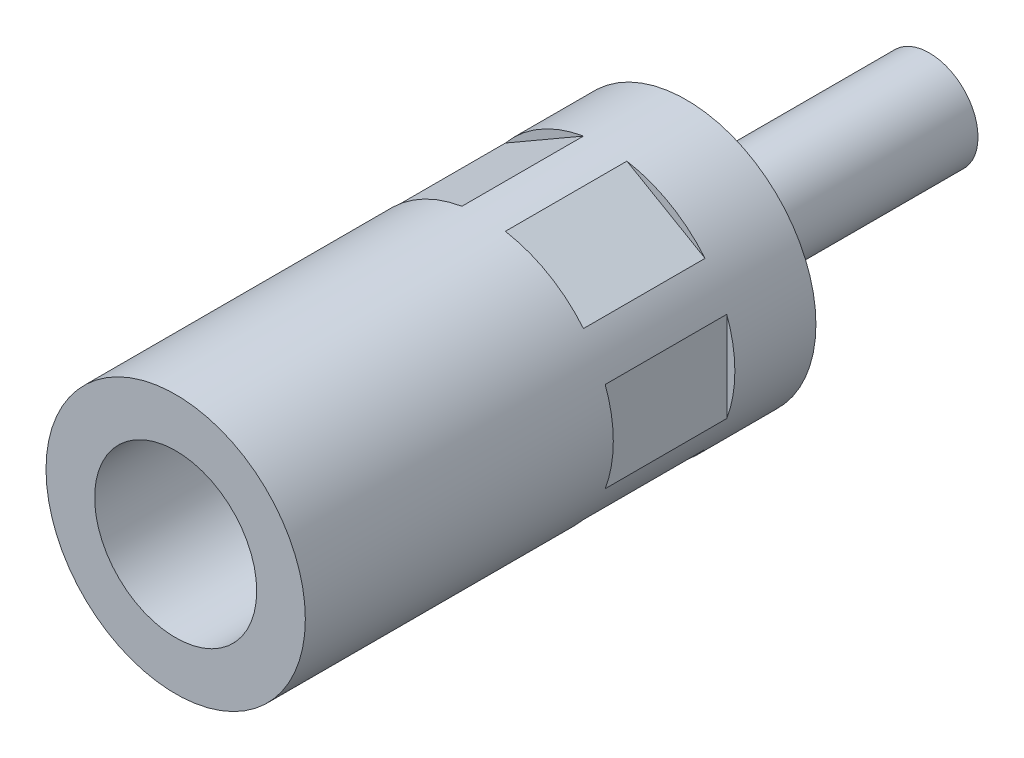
ISO-10303-21;
HEADER;
FILE_DESCRIPTION(('STEP AP214'),'2;1');
FILE_NAME('part.step','',(''),(''),'','','');
FILE_SCHEMA(('AUTOMOTIVE_DESIGN { 1 0 10303 214 1 1 1 1 }'));
ENDSEC;
DATA;
#1=APPLICATION_CONTEXT('core data for automotive mechanical design processes');
#2=APPLICATION_PROTOCOL_DEFINITION('international standard','automotive_design',2000,#1);
#3=PRODUCT_CONTEXT('',#1,'mechanical');
#4=PRODUCT('Part','Part','',(#3));
#5=PRODUCT_RELATED_PRODUCT_CATEGORY('part','',(#4));
#6=PRODUCT_DEFINITION_FORMATION('','',#4);
#7=PRODUCT_DEFINITION_CONTEXT('part definition',#1,'design');
#8=PRODUCT_DEFINITION('design','',#6,#7);
#9=PRODUCT_DEFINITION_SHAPE('','',#8);
#10=(LENGTH_UNIT() NAMED_UNIT(*) SI_UNIT(.MILLI.,.METRE.));
#11=(NAMED_UNIT(*) PLANE_ANGLE_UNIT() SI_UNIT($,.RADIAN.));
#12=(NAMED_UNIT(*) SI_UNIT($,.STERADIAN.) SOLID_ANGLE_UNIT());
#13=UNCERTAINTY_MEASURE_WITH_UNIT(LENGTH_MEASURE(1.E-05),#10,'distance_accuracy_value','');
#14=(GEOMETRIC_REPRESENTATION_CONTEXT(3) GLOBAL_UNCERTAINTY_ASSIGNED_CONTEXT((#13)) GLOBAL_UNIT_ASSIGNED_CONTEXT((#10,
#11,#12)) REPRESENTATION_CONTEXT('',''));
#15=CARTESIAN_POINT('',(0.,0.,0.));
#16=DIRECTION('',(0.,0.,1.));
#17=DIRECTION('',(1.,0.,0.));
#18=AXIS2_PLACEMENT_3D('',#15,#16,#17);
#19=CARTESIAN_POINT('',(0.,0.,80.));
#20=DIRECTION('',(0.,0.,1.));
#21=DIRECTION('',(1.,0.,0.));
#22=AXIS2_PLACEMENT_3D('',#19,#20,#21);
#23=CYLINDRICAL_SURFACE('',#22,16.);
#24=CARTESIAN_POINT('',(0.,0.,10.));
#25=DIRECTION('',(0.,0.,1.));
#26=DIRECTION('',(1.,0.,0.));
#27=AXIS2_PLACEMENT_3D('',#24,#25,#26);
#28=CIRCLE('',#27,16.);
#29=CARTESIAN_POINT('',(-12.3218253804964,-10.2064988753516,10.));
#30=VERTEX_POINT('',#29);
#31=CARTESIAN_POINT('',(-2.67817461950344,-15.7742632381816,10.));
#32=VERTEX_POINT('',#31);
#33=EDGE_CURVE('E153',#30,#32,#28,.T.);
#34=ORIENTED_EDGE('',*,*,#33,.F.);
#35=DIRECTION('',(0.,0.,1.));
#36=VECTOR('',#35,1.);
#37=CARTESIAN_POINT('',(-12.3218253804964,-10.2064988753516,80.));
#38=LINE('',#37,#36);
#39=CARTESIAN_POINT('',(-12.3218253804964,-10.2064988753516,25.));
#40=VERTEX_POINT('',#39);
#41=EDGE_CURVE('E9',#30,#40,#38,.T.);
#42=ORIENTED_EDGE('',*,*,#41,.T.);
#43=CARTESIAN_POINT('',(0.,0.,25.));
#44=DIRECTION('',(0.,0.,1.));
#45=DIRECTION('',(1.,0.,0.));
#46=AXIS2_PLACEMENT_3D('',#43,#44,#45);
#47=CIRCLE('',#46,16.);
#48=CARTESIAN_POINT('',(-2.67817461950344,-15.7742632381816,25.));
#49=VERTEX_POINT('',#48);
#50=EDGE_CURVE('E22',#40,#49,#47,.T.);
#51=ORIENTED_EDGE('',*,*,#50,.T.);
#52=DIRECTION('',(0.,0.,1.));
#53=VECTOR('',#52,1.);
#54=CARTESIAN_POINT('',(-2.67817461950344,-15.7742632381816,80.));
#55=LINE('',#54,#53);
#56=EDGE_CURVE('E150',#49,#32,#55,.F.);
#57=ORIENTED_EDGE('',*,*,#56,.T.);
#58=EDGE_LOOP('',(#34,#42,#51,#57));
#59=FACE_BOUND('',#58,.T.);
#60=DIRECTION('',(0.,0.,1.));
#61=VECTOR('',#60,1.);
#62=CARTESIAN_POINT('',(15.,5.56776436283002,80.));
#63=LINE('',#62,#61);
#64=CARTESIAN_POINT('',(15.,5.56776436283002,10.));
#65=VERTEX_POINT('',#64);
#66=CARTESIAN_POINT('',(15.,5.56776436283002,25.));
#67=VERTEX_POINT('',#66);
#68=EDGE_CURVE('E143',#65,#67,#63,.T.);
#69=ORIENTED_EDGE('',*,*,#68,.F.);
#70=CARTESIAN_POINT('',(15.,-5.56776436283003,10.));
#71=VERTEX_POINT('',#70);
#72=EDGE_CURVE('E142',#71,#65,#28,.T.);
#73=ORIENTED_EDGE('',*,*,#72,.F.);
#74=DIRECTION('',(0.,0.,1.));
#75=VECTOR('',#74,1.);
#76=CARTESIAN_POINT('',(15.,-5.56776436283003,80.));
#77=LINE('',#76,#75);
#78=CARTESIAN_POINT('',(15.,-5.56776436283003,25.));
#79=VERTEX_POINT('',#78);
#80=EDGE_CURVE('E139',#79,#71,#77,.F.);
#81=ORIENTED_EDGE('',*,*,#80,.F.);
#82=EDGE_CURVE('E146',#79,#67,#47,.T.);
#83=ORIENTED_EDGE('',*,*,#82,.T.);
#84=EDGE_LOOP('',(#69,#73,#81,#83));
#85=FACE_BOUND('',#84,.T.);
#86=CARTESIAN_POINT('',(12.3218253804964,10.2064988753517,10.));
#87=VERTEX_POINT('',#86);
#88=CARTESIAN_POINT('',(2.67817461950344,15.7742632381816,10.));
#89=VERTEX_POINT('',#88);
#90=EDGE_CURVE('E135',#87,#89,#28,.T.);
#91=ORIENTED_EDGE('',*,*,#90,.F.);
#92=DIRECTION('',(0.,0.,1.));
#93=VECTOR('',#92,1.);
#94=CARTESIAN_POINT('',(12.3218253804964,10.2064988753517,80.));
#95=LINE('',#94,#93);
#96=CARTESIAN_POINT('',(12.3218253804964,10.2064988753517,25.));
#97=VERTEX_POINT('',#96);
#98=EDGE_CURVE('E136',#87,#97,#95,.T.);
#99=ORIENTED_EDGE('',*,*,#98,.T.);
#100=CARTESIAN_POINT('',(2.67817461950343,15.7742632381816,25.));
#101=VERTEX_POINT('',#100);
#102=EDGE_CURVE('E140',#97,#101,#47,.T.);
#103=ORIENTED_EDGE('',*,*,#102,.T.);
#104=DIRECTION('',(0.,0.,1.));
#105=VECTOR('',#104,1.);
#106=CARTESIAN_POINT('',(2.67817461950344,15.7742632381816,80.));
#107=LINE('',#106,#105);
#108=EDGE_CURVE('E132',#101,#89,#107,.F.);
#109=ORIENTED_EDGE('',*,*,#108,.T.);
#110=EDGE_LOOP('',(#91,#99,#103,#109));
#111=FACE_BOUND('',#110,.T.);
#112=CARTESIAN_POINT('',(0.,0.,0.));
#113=DIRECTION('',(0.,0.,1.));
#114=DIRECTION('',(1.,0.,0.));
#115=AXIS2_PLACEMENT_3D('',#112,#113,#114);
#116=CIRCLE('',#115,16.);
#117=CARTESIAN_POINT('',(16.,0.,0.));
#118=VERTEX_POINT('',#117);
#119=EDGE_CURVE('E202',#118,#118,#116,.T.);
#120=ORIENTED_EDGE('',*,*,#119,.T.);
#121=EDGE_LOOP('',(#120));
#122=FACE_BOUND('',#121,.T.);
#123=CARTESIAN_POINT('',(0.,0.,63.));
#124=DIRECTION('',(0.,0.,1.));
#125=DIRECTION('',(1.,0.,0.));
#126=AXIS2_PLACEMENT_3D('',#123,#124,#125);
#127=CIRCLE('',#126,16.);
#128=CARTESIAN_POINT('',(16.,0.,63.));
#129=VERTEX_POINT('',#128);
#130=EDGE_CURVE('E205',#129,#129,#127,.T.);
#131=ORIENTED_EDGE('',*,*,#130,.F.);
#132=EDGE_LOOP('',(#131));
#133=FACE_BOUND('',#132,.T.);
#134=CARTESIAN_POINT('',(-15.,5.56776436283,10.));
#135=VERTEX_POINT('',#134);
#136=CARTESIAN_POINT('',(-15.,-5.56776436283,10.));
#137=VERTEX_POINT('',#136);
#138=EDGE_CURVE('E111',#135,#137,#28,.T.);
#139=ORIENTED_EDGE('',*,*,#138,.F.);
#140=DIRECTION('',(0.,0.,1.));
#141=VECTOR('',#140,1.);
#142=CARTESIAN_POINT('',(-15.,5.56776436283,80.));
#143=LINE('',#142,#141);
#144=CARTESIAN_POINT('',(-15.,5.56776436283,25.));
#145=VERTEX_POINT('',#144);
#146=EDGE_CURVE('E110',#135,#145,#143,.T.);
#147=ORIENTED_EDGE('',*,*,#146,.T.);
#148=CARTESIAN_POINT('',(-15.,-5.56776436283,25.));
#149=VERTEX_POINT('',#148);
#150=EDGE_CURVE('E103',#145,#149,#47,.T.);
#151=ORIENTED_EDGE('',*,*,#150,.T.);
#152=DIRECTION('',(0.,0.,1.));
#153=VECTOR('',#152,1.);
#154=CARTESIAN_POINT('',(-15.,-5.56776436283,80.));
#155=LINE('',#154,#153);
#156=EDGE_CURVE('E117',#149,#137,#155,.F.);
#157=ORIENTED_EDGE('',*,*,#156,.T.);
#158=EDGE_LOOP('',(#139,#147,#151,#157));
#159=FACE_BOUND('',#158,.T.);
#160=DIRECTION('',(0.,0.,1.));
#161=VECTOR('',#160,1.);
#162=CARTESIAN_POINT('',(-12.3218253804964,10.2064988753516,80.));
#163=LINE('',#162,#161);
#164=CARTESIAN_POINT('',(-12.3218253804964,10.2064988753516,10.));
#165=VERTEX_POINT('',#164);
#166=CARTESIAN_POINT('',(-12.3218253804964,10.2064988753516,25.));
#167=VERTEX_POINT('',#166);
#168=EDGE_CURVE('E130',#165,#167,#163,.T.);
#169=ORIENTED_EDGE('',*,*,#168,.F.);
#170=CARTESIAN_POINT('',(-2.67817461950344,15.7742632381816,10.));
#171=VERTEX_POINT('',#170);
#172=EDGE_CURVE('E126',#171,#165,#28,.T.);
#173=ORIENTED_EDGE('',*,*,#172,.F.);
#174=DIRECTION('',(0.,0.,1.));
#175=VECTOR('',#174,1.);
#176=CARTESIAN_POINT('',(-2.67817461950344,15.7742632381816,80.));
#177=LINE('',#176,#175);
#178=CARTESIAN_POINT('',(-2.67817461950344,15.7742632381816,25.));
#179=VERTEX_POINT('',#178);
#180=EDGE_CURVE('E124',#179,#171,#177,.F.);
#181=ORIENTED_EDGE('',*,*,#180,.F.);
#182=EDGE_CURVE('E113',#179,#167,#47,.T.);
#183=ORIENTED_EDGE('',*,*,#182,.T.);
#184=EDGE_LOOP('',(#169,#173,#181,#183));
#185=FACE_BOUND('',#184,.T.);
#186=DIRECTION('',(0.,0.,1.));
#187=VECTOR('',#186,1.);
#188=CARTESIAN_POINT('',(12.3218253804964,-10.2064988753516,80.));
#189=LINE('',#188,#187);
#190=CARTESIAN_POINT('',(12.3218253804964,-10.2064988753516,10.));
#191=VERTEX_POINT('',#190);
#192=CARTESIAN_POINT('',(12.3218253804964,-10.2064988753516,25.));
#193=VERTEX_POINT('',#192);
#194=EDGE_CURVE('E149',#191,#193,#189,.T.);
#195=ORIENTED_EDGE('',*,*,#194,.F.);
#196=CARTESIAN_POINT('',(2.67817461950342,-15.7742632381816,10.));
#197=VERTEX_POINT('',#196);
#198=EDGE_CURVE('E148',#197,#191,#28,.T.);
#199=ORIENTED_EDGE('',*,*,#198,.F.);
#200=DIRECTION('',(0.,0.,1.));
#201=VECTOR('',#200,1.);
#202=CARTESIAN_POINT('',(2.67817461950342,-15.7742632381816,80.));
#203=LINE('',#202,#201);
#204=CARTESIAN_POINT('',(2.67817461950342,-15.7742632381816,25.));
#205=VERTEX_POINT('',#204);
#206=EDGE_CURVE('E145',#205,#197,#203,.F.);
#207=ORIENTED_EDGE('',*,*,#206,.F.);
#208=EDGE_CURVE('E151',#205,#193,#47,.T.);
#209=ORIENTED_EDGE('',*,*,#208,.T.);
#210=EDGE_LOOP('',(#195,#199,#207,#209));
#211=FACE_BOUND('',#210,.T.);
#212=ADVANCED_FACE('F14',(#59,#85,#111,#122,#133,#159,#185,#211),#23,.T.);
#213=CARTESIAN_POINT('',(0.,0.,-30.));
#214=DIRECTION('',(0.,0.,1.));
#215=DIRECTION('',(1.,0.,0.));
#216=AXIS2_PLACEMENT_3D('',#213,#214,#215);
#217=PLANE('',#216);
#218=CARTESIAN_POINT('',(0.,0.,-30.));
#219=DIRECTION('',(0.,0.,1.));
#220=DIRECTION('',(1.,0.,0.));
#221=AXIS2_PLACEMENT_3D('',#218,#219,#220);
#222=CIRCLE('',#221,6.);
#223=CARTESIAN_POINT('',(6.,0.,-30.));
#224=VERTEX_POINT('',#223);
#225=EDGE_CURVE('E118',#224,#224,#222,.T.);
#226=ORIENTED_EDGE('',*,*,#225,.F.);
#227=EDGE_LOOP('',(#226));
#228=FACE_BOUND('',#227,.T.);
#229=ADVANCED_FACE('F16',(#228),#217,.F.);
#230=CARTESIAN_POINT('',(5.,0.,9.));
#231=DIRECTION('',(0.,0.,-1.));
#232=DIRECTION('',(-1.,0.,0.));
#233=AXIS2_PLACEMENT_3D('',#230,#231,#232);
#234=PLANE('',#233);
#235=CARTESIAN_POINT('',(0.,0.,9.));
#236=DIRECTION('',(0.,0.,1.));
#237=DIRECTION('',(1.,0.,0.));
#238=AXIS2_PLACEMENT_3D('',#235,#236,#237);
#239=CIRCLE('',#238,5.);
#240=CARTESIAN_POINT('',(5.,0.,9.));
#241=VERTEX_POINT('',#240);
#242=EDGE_CURVE('E160',#241,#241,#239,.T.);
#243=ORIENTED_EDGE('',*,*,#242,.T.);
#244=EDGE_LOOP('',(#243));
#245=FACE_BOUND('',#244,.T.);
#246=ADVANCED_FACE('F220',(#245),#234,.F.);
#247=CARTESIAN_POINT('',(0.,0.,80.));
#248=DIRECTION('',(0.,0.,1.));
#249=DIRECTION('',(1.,0.,0.));
#250=AXIS2_PLACEMENT_3D('',#247,#248,#249);
#251=CYLINDRICAL_SURFACE('',#250,5.);
#252=ORIENTED_EDGE('',*,*,#242,.F.);
#253=EDGE_LOOP('',(#252));
#254=FACE_BOUND('',#253,.T.);
#255=CARTESIAN_POINT('',(0.,0.,33.));
#256=DIRECTION('',(0.,0.,1.));
#257=DIRECTION('',(1.,0.,0.));
#258=AXIS2_PLACEMENT_3D('',#255,#256,#257);
#259=CIRCLE('',#258,5.);
#260=CARTESIAN_POINT('',(5.,0.,33.));
#261=VERTEX_POINT('',#260);
#262=EDGE_CURVE('E214',#261,#261,#259,.T.);
#263=ORIENTED_EDGE('',*,*,#262,.T.);
#264=EDGE_LOOP('',(#263));
#265=FACE_BOUND('',#264,.T.);
#266=ADVANCED_FACE('F222',(#254,#265),#251,.F.);
#267=CARTESIAN_POINT('',(5.,0.,33.));
#268=DIRECTION('',(0.,0.,1.));
#269=DIRECTION('',(1.,0.,0.));
#270=AXIS2_PLACEMENT_3D('',#267,#268,#269);
#271=PLANE('',#270);
#272=CARTESIAN_POINT('',(0.,0.,33.));
#273=DIRECTION('',(0.,0.,1.));
#274=DIRECTION('',(1.,0.,0.));
#275=AXIS2_PLACEMENT_3D('',#272,#273,#274);
#276=CIRCLE('',#275,10.);
#277=CARTESIAN_POINT('',(10.,0.,33.));
#278=VERTEX_POINT('',#277);
#279=EDGE_CURVE('E211',#278,#278,#276,.T.);
#280=ORIENTED_EDGE('',*,*,#279,.T.);
#281=EDGE_LOOP('',(#280));
#282=FACE_BOUND('',#281,.T.);
#283=ORIENTED_EDGE('',*,*,#262,.F.);
#284=EDGE_LOOP('',(#283));
#285=FACE_BOUND('',#284,.T.);
#286=ADVANCED_FACE('F225',(#282,#285),#271,.T.);
#287=CARTESIAN_POINT('',(0.,0.,80.));
#288=DIRECTION('',(0.,0.,1.));
#289=DIRECTION('',(1.,0.,0.));
#290=AXIS2_PLACEMENT_3D('',#287,#288,#289);
#291=CYLINDRICAL_SURFACE('',#290,10.);
#292=ORIENTED_EDGE('',*,*,#279,.F.);
#293=EDGE_LOOP('',(#292));
#294=FACE_BOUND('',#293,.T.);
#295=CARTESIAN_POINT('',(0.,0.,63.));
#296=DIRECTION('',(0.,0.,1.));
#297=DIRECTION('',(1.,0.,0.));
#298=AXIS2_PLACEMENT_3D('',#295,#296,#297);
#299=CIRCLE('',#298,10.);
#300=CARTESIAN_POINT('',(10.,0.,63.));
#301=VERTEX_POINT('',#300);
#302=EDGE_CURVE('E208',#301,#301,#299,.T.);
#303=ORIENTED_EDGE('',*,*,#302,.T.);
#304=EDGE_LOOP('',(#303));
#305=FACE_BOUND('',#304,.T.);
#306=ADVANCED_FACE('F230',(#294,#305),#291,.F.);
#307=CARTESIAN_POINT('',(16.,0.,63.));
#308=DIRECTION('',(0.,0.,-1.));
#309=DIRECTION('',(-1.,0.,0.));
#310=AXIS2_PLACEMENT_3D('',#307,#308,#309);
#311=PLANE('',#310);
#312=ORIENTED_EDGE('',*,*,#302,.F.);
#313=EDGE_LOOP('',(#312));
#314=FACE_BOUND('',#313,.T.);
#315=ORIENTED_EDGE('',*,*,#130,.T.);
#316=EDGE_LOOP('',(#315));
#317=FACE_BOUND('',#316,.T.);
#318=ADVANCED_FACE('F238',(#314,#317),#311,.F.);
#319=CARTESIAN_POINT('',(16.,0.,0.));
#320=DIRECTION('',(0.,0.,-1.));
#321=DIRECTION('',(-1.,0.,0.));
#322=AXIS2_PLACEMENT_3D('',#319,#320,#321);
#323=PLANE('',#322);
#324=CARTESIAN_POINT('',(0.,0.,0.));
#325=DIRECTION('',(0.,0.,1.));
#326=DIRECTION('',(1.,0.,0.));
#327=AXIS2_PLACEMENT_3D('',#324,#325,#326);
#328=CIRCLE('',#327,6.);
#329=CARTESIAN_POINT('',(6.,0.,0.));
#330=VERTEX_POINT('',#329);
#331=EDGE_CURVE('E199',#330,#330,#328,.T.);
#332=ORIENTED_EDGE('',*,*,#331,.T.);
#333=EDGE_LOOP('',(#332));
#334=FACE_BOUND('',#333,.T.);
#335=ORIENTED_EDGE('',*,*,#119,.F.);
#336=EDGE_LOOP('',(#335));
#337=FACE_BOUND('',#336,.T.);
#338=ADVANCED_FACE('F250',(#334,#337),#323,.T.);
#339=CARTESIAN_POINT('',(0.,0.,80.));
#340=DIRECTION('',(0.,0.,1.));
#341=DIRECTION('',(1.,0.,0.));
#342=AXIS2_PLACEMENT_3D('',#339,#340,#341);
#343=CYLINDRICAL_SURFACE('',#342,6.);
#344=ORIENTED_EDGE('',*,*,#331,.F.);
#345=EDGE_LOOP('',(#344));
#346=FACE_BOUND('',#345,.T.);
#347=ORIENTED_EDGE('',*,*,#225,.T.);
#348=EDGE_LOOP('',(#347));
#349=FACE_BOUND('',#348,.T.);
#350=ADVANCED_FACE('F258',(#346,#349),#343,.T.);
#351=CARTESIAN_POINT('',(-15.,8.66025403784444,25.));
#352=DIRECTION('',(1.,0.,0.));
#353=DIRECTION('',(0.,1.,0.));
#354=AXIS2_PLACEMENT_3D('',#351,#352,#353);
#355=PLANE('',#354);
#356=DIRECTION('',(0.,-1.,0.));
#357=VECTOR('',#356,1.);
#358=CARTESIAN_POINT('',(-15.,8.66025403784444,10.));
#359=LINE('',#358,#357);
#360=EDGE_CURVE('E193',#135,#137,#359,.T.);
#361=ORIENTED_EDGE('',*,*,#360,.T.);
#362=ORIENTED_EDGE('',*,*,#156,.F.);
#363=DIRECTION('',(0.,-1.,0.));
#364=VECTOR('',#363,1.);
#365=CARTESIAN_POINT('',(-15.,8.66025403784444,25.));
#366=LINE('',#365,#364);
#367=EDGE_CURVE('E106',#145,#149,#366,.T.);
#368=ORIENTED_EDGE('',*,*,#367,.F.);
#369=ORIENTED_EDGE('',*,*,#146,.F.);
#370=EDGE_LOOP('',(#361,#362,#368,#369));
#371=FACE_BOUND('',#370,.T.);
#372=ADVANCED_FACE('F115',(#371),#355,.F.);
#373=CARTESIAN_POINT('',(0.,0.,10.));
#374=DIRECTION('',(0.,0.,1.));
#375=DIRECTION('',(1.,0.,0.));
#376=AXIS2_PLACEMENT_3D('',#373,#374,#375);
#377=PLANE('',#376);
#378=ORIENTED_EDGE('',*,*,#138,.T.);
#379=ORIENTED_EDGE('',*,*,#360,.F.);
#380=EDGE_LOOP('',(#378,#379));
#381=FACE_BOUND('',#380,.T.);
#382=ADVANCED_FACE('F280',(#381),#377,.T.);
#383=CARTESIAN_POINT('',(0.,0.,25.));
#384=DIRECTION('',(0.,0.,1.));
#385=DIRECTION('',(1.,0.,0.));
#386=AXIS2_PLACEMENT_3D('',#383,#384,#385);
#387=PLANE('',#386);
#388=ORIENTED_EDGE('',*,*,#367,.T.);
#389=ORIENTED_EDGE('',*,*,#150,.F.);
#390=EDGE_LOOP('',(#388,#389));
#391=FACE_BOUND('',#390,.T.);
#392=ADVANCED_FACE('F105',(#391),#387,.F.);
#393=CARTESIAN_POINT('',(-15.,8.66025403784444,25.));
#394=DIRECTION('',(-0.5,0.866025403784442,0.));
#395=DIRECTION('',(-0.866025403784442,-0.5,0.));
#396=AXIS2_PLACEMENT_3D('',#393,#394,#395);
#397=PLANE('',#396);
#398=ORIENTED_EDGE('',*,*,#168,.T.);
#399=DIRECTION('',(0.866025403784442,0.5,0.));
#400=VECTOR('',#399,1.);
#401=CARTESIAN_POINT('',(-15.,8.66025403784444,25.));
#402=LINE('',#401,#400);
#403=EDGE_CURVE('E119',#167,#179,#402,.T.);
#404=ORIENTED_EDGE('',*,*,#403,.T.);
#405=ORIENTED_EDGE('',*,*,#180,.T.);
#406=DIRECTION('',(0.866025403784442,0.5,0.));
#407=VECTOR('',#406,1.);
#408=CARTESIAN_POINT('',(-15.,8.66025403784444,10.));
#409=LINE('',#408,#407);
#410=EDGE_CURVE('E344',#165,#171,#409,.T.);
#411=ORIENTED_EDGE('',*,*,#410,.F.);
#412=EDGE_LOOP('',(#398,#404,#405,#411));
#413=FACE_BOUND('',#412,.T.);
#414=ADVANCED_FACE('F306',(#413),#397,.T.);
#415=ORIENTED_EDGE('',*,*,#172,.T.);
#416=ORIENTED_EDGE('',*,*,#410,.T.);
#417=EDGE_LOOP('',(#415,#416));
#418=FACE_BOUND('',#417,.T.);
#419=ADVANCED_FACE('F294',(#418),#377,.T.);
#420=ORIENTED_EDGE('',*,*,#403,.F.);
#421=ORIENTED_EDGE('',*,*,#182,.F.);
#422=EDGE_LOOP('',(#420,#421));
#423=FACE_BOUND('',#422,.T.);
#424=ADVANCED_FACE('F289',(#423),#387,.F.);
#425=CARTESIAN_POINT('',(15.,8.66025403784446,25.));
#426=DIRECTION('',(-0.499999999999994,-0.866025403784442,0.));
#427=DIRECTION('',(0.866025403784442,-0.499999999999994,0.));
#428=AXIS2_PLACEMENT_3D('',#425,#426,#427);
#429=PLANE('',#428);
#430=DIRECTION('',(-0.866025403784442,0.499999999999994,0.));
#431=VECTOR('',#430,1.);
#432=CARTESIAN_POINT('',(15.,8.66025403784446,10.));
#433=LINE('',#432,#431);
#434=EDGE_CURVE('E345',#87,#89,#433,.T.);
#435=ORIENTED_EDGE('',*,*,#434,.T.);
#436=ORIENTED_EDGE('',*,*,#108,.F.);
#437=DIRECTION('',(-0.866025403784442,0.499999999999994,0.));
#438=VECTOR('',#437,1.);
#439=CARTESIAN_POINT('',(15.,8.66025403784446,25.));
#440=LINE('',#439,#438);
#441=EDGE_CURVE('E190',#97,#101,#440,.T.);
#442=ORIENTED_EDGE('',*,*,#441,.F.);
#443=ORIENTED_EDGE('',*,*,#98,.F.);
#444=EDGE_LOOP('',(#435,#436,#442,#443));
#445=FACE_BOUND('',#444,.T.);
#446=ADVANCED_FACE('F293',(#445),#429,.F.);
#447=ORIENTED_EDGE('',*,*,#90,.T.);
#448=ORIENTED_EDGE('',*,*,#434,.F.);
#449=EDGE_LOOP('',(#447,#448));
#450=FACE_BOUND('',#449,.T.);
#451=ADVANCED_FACE('F287',(#450),#377,.T.);
#452=ORIENTED_EDGE('',*,*,#441,.T.);
#453=ORIENTED_EDGE('',*,*,#102,.F.);
#454=EDGE_LOOP('',(#452,#453));
#455=FACE_BOUND('',#454,.T.);
#456=ADVANCED_FACE('F283',(#455),#387,.F.);
#457=CARTESIAN_POINT('',(15.,8.66025403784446,25.));
#458=DIRECTION('',(1.,0.,0.));
#459=DIRECTION('',(0.,1.,0.));
#460=AXIS2_PLACEMENT_3D('',#457,#458,#459);
#461=PLANE('',#460);
#462=ORIENTED_EDGE('',*,*,#68,.T.);
#463=DIRECTION('',(0.,-1.,0.));
#464=VECTOR('',#463,1.);
#465=CARTESIAN_POINT('',(15.,8.66025403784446,25.));
#466=LINE('',#465,#464);
#467=EDGE_CURVE('E187',#67,#79,#466,.T.);
#468=ORIENTED_EDGE('',*,*,#467,.T.);
#469=ORIENTED_EDGE('',*,*,#80,.T.);
#470=DIRECTION('',(0.,-1.,0.));
#471=VECTOR('',#470,1.);
#472=CARTESIAN_POINT('',(15.,8.66025403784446,10.));
#473=LINE('',#472,#471);
#474=EDGE_CURVE('E348',#65,#71,#473,.T.);
#475=ORIENTED_EDGE('',*,*,#474,.F.);
#476=EDGE_LOOP('',(#462,#468,#469,#475));
#477=FACE_BOUND('',#476,.T.);
#478=ADVANCED_FACE('F286',(#477),#461,.T.);
#479=ORIENTED_EDGE('',*,*,#72,.T.);
#480=ORIENTED_EDGE('',*,*,#474,.T.);
#481=EDGE_LOOP('',(#479,#480));
#482=FACE_BOUND('',#481,.T.);
#483=ADVANCED_FACE('F295',(#482),#377,.T.);
#484=ORIENTED_EDGE('',*,*,#467,.F.);
#485=ORIENTED_EDGE('',*,*,#82,.F.);
#486=EDGE_LOOP('',(#484,#485));
#487=FACE_BOUND('',#486,.T.);
#488=ADVANCED_FACE('F290',(#487),#387,.F.);
#489=CARTESIAN_POINT('',(15.,-8.66025403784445,25.));
#490=DIRECTION('',(0.5,-0.866025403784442,0.));
#491=DIRECTION('',(0.866025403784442,0.5,0.));
#492=AXIS2_PLACEMENT_3D('',#489,#490,#491);
#493=PLANE('',#492);
#494=ORIENTED_EDGE('',*,*,#194,.T.);
#495=DIRECTION('',(-0.866025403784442,-0.5,0.));
#496=VECTOR('',#495,1.);
#497=CARTESIAN_POINT('',(15.,-8.66025403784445,25.));
#498=LINE('',#497,#496);
#499=EDGE_CURVE('E37',#193,#205,#498,.T.);
#500=ORIENTED_EDGE('',*,*,#499,.T.);
#501=ORIENTED_EDGE('',*,*,#206,.T.);
#502=DIRECTION('',(-0.866025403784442,-0.5,0.));
#503=VECTOR('',#502,1.);
#504=CARTESIAN_POINT('',(15.,-8.66025403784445,10.));
#505=LINE('',#504,#503);
#506=EDGE_CURVE('E352',#191,#197,#505,.T.);
#507=ORIENTED_EDGE('',*,*,#506,.F.);
#508=EDGE_LOOP('',(#494,#500,#501,#507));
#509=FACE_BOUND('',#508,.T.);
#510=ADVANCED_FACE('F296',(#509),#493,.T.);
#511=ORIENTED_EDGE('',*,*,#198,.T.);
#512=ORIENTED_EDGE('',*,*,#506,.T.);
#513=EDGE_LOOP('',(#511,#512));
#514=FACE_BOUND('',#513,.T.);
#515=ADVANCED_FACE('F299',(#514),#377,.T.);
#516=ORIENTED_EDGE('',*,*,#499,.F.);
#517=ORIENTED_EDGE('',*,*,#208,.F.);
#518=EDGE_LOOP('',(#516,#517));
#519=FACE_BOUND('',#518,.T.);
#520=ADVANCED_FACE('F186',(#519),#387,.F.);
#521=DIRECTION('',(0.866025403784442,-0.5,0.));
#522=VECTOR('',#521,1.);
#523=CARTESIAN_POINT('',(-15.,-8.66025403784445,25.));
#524=LINE('',#523,#522);
#525=EDGE_CURVE('E188',#40,#49,#524,.T.);
#526=ORIENTED_EDGE('',*,*,#525,.T.);
#527=ORIENTED_EDGE('',*,*,#50,.F.);
#528=EDGE_LOOP('',(#526,#527));
#529=FACE_BOUND('',#528,.T.);
#530=ADVANCED_FACE('F317',(#529),#387,.F.);
#531=ORIENTED_EDGE('',*,*,#33,.T.);
#532=DIRECTION('',(0.866025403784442,-0.5,0.));
#533=VECTOR('',#532,1.);
#534=CARTESIAN_POINT('',(-15.,-8.66025403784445,10.));
#535=LINE('',#534,#533);
#536=EDGE_CURVE('E29',#30,#32,#535,.T.);
#537=ORIENTED_EDGE('',*,*,#536,.F.);
#538=EDGE_LOOP('',(#531,#537));
#539=FACE_BOUND('',#538,.T.);
#540=ADVANCED_FACE('F312',(#539),#377,.T.);
#541=CARTESIAN_POINT('',(-15.,-8.66025403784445,25.));
#542=DIRECTION('',(0.5,0.866025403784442,0.));
#543=DIRECTION('',(-0.866025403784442,0.5,0.));
#544=AXIS2_PLACEMENT_3D('',#541,#542,#543);
#545=PLANE('',#544);
#546=ORIENTED_EDGE('',*,*,#536,.T.);
#547=ORIENTED_EDGE('',*,*,#56,.F.);
#548=ORIENTED_EDGE('',*,*,#525,.F.);
#549=ORIENTED_EDGE('',*,*,#41,.F.);
#550=EDGE_LOOP('',(#546,#547,#548,#549));
#551=FACE_BOUND('',#550,.T.);
#552=ADVANCED_FACE('F310',(#551),#545,.F.);
#553=CLOSED_SHELL('',(#212,#229,#246,#266,#286,#306,#318,#338,#350,#372,#382,#392,#414,#419,
#424,#446,#451,#456,#478,#483,#488,#510,#515,#520,#530,#540,#552));
#554=MANIFOLD_SOLID_BREP('B1',#553);
#555=ADVANCED_BREP_SHAPE_REPRESENTATION('',(#18,#554),#14);
#556=SHAPE_DEFINITION_REPRESENTATION(#9,#555);
ENDSEC;
END-ISO-10303-21;
